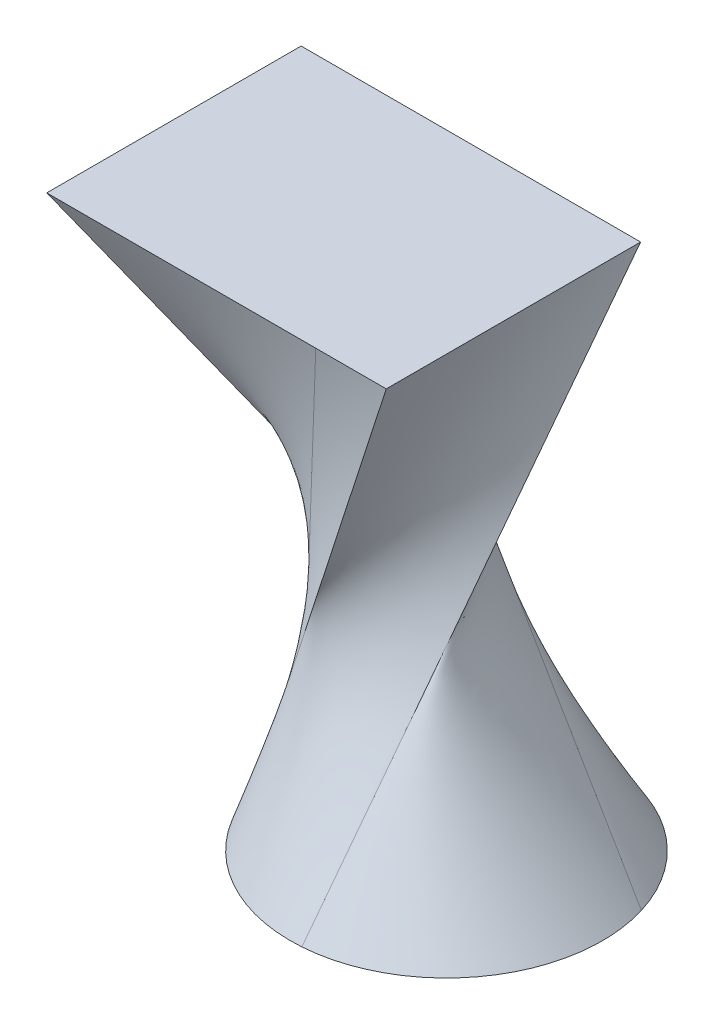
ISO-10303-21;
HEADER;
FILE_DESCRIPTION(('STEP AP214'),'2;1');
FILE_NAME('part.step','',(''),(''),'','','');
FILE_SCHEMA(('AUTOMOTIVE_DESIGN { 1 0 10303 214 1 1 1 1 }'));
ENDSEC;
DATA;
#1=APPLICATION_CONTEXT('core data for automotive mechanical design processes');
#2=APPLICATION_PROTOCOL_DEFINITION('international standard','automotive_design',2000,#1);
#3=PRODUCT_CONTEXT('',#1,'mechanical');
#4=PRODUCT('Part','Part','',(#3));
#5=PRODUCT_RELATED_PRODUCT_CATEGORY('part','',(#4));
#6=PRODUCT_DEFINITION_FORMATION('','',#4);
#7=PRODUCT_DEFINITION_CONTEXT('part definition',#1,'design');
#8=PRODUCT_DEFINITION('design','',#6,#7);
#9=PRODUCT_DEFINITION_SHAPE('','',#8);
#10=(LENGTH_UNIT() NAMED_UNIT(*) SI_UNIT(.MILLI.,.METRE.));
#11=(NAMED_UNIT(*) PLANE_ANGLE_UNIT() SI_UNIT($,.RADIAN.));
#12=(NAMED_UNIT(*) SI_UNIT($,.STERADIAN.) SOLID_ANGLE_UNIT());
#13=UNCERTAINTY_MEASURE_WITH_UNIT(LENGTH_MEASURE(1.E-05),#10,'distance_accuracy_value','');
#14=(GEOMETRIC_REPRESENTATION_CONTEXT(3) GLOBAL_UNCERTAINTY_ASSIGNED_CONTEXT((#13)) GLOBAL_UNIT_ASSIGNED_CONTEXT((#10,
#11,#12)) REPRESENTATION_CONTEXT('',''));
#15=CARTESIAN_POINT('',(0.,0.,0.));
#16=DIRECTION('',(0.,0.,1.));
#17=DIRECTION('',(1.,0.,0.));
#18=AXIS2_PLACEMENT_3D('',#15,#16,#17);
#19=CARTESIAN_POINT('',(-18.3758165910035,177.8,32.8585585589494));
#20=CARTESIAN_POINT('',(-61.0265949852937,0.,-4.67272512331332));
#21=CARTESIAN_POINT('',(-22.7694829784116,177.8,32.8585585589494));
#22=CARTESIAN_POINT('',(-60.7495294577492,0.,-8.29124863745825));
#23=CARTESIAN_POINT('',(-31.556815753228,177.8,32.8585585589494));
#24=CARTESIAN_POINT('',(-59.550185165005,0.,-15.4788341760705));
#25=CARTESIAN_POINT('',(-44.7378149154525,177.8,32.8585585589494));
#26=CARTESIAN_POINT('',(-55.8714944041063,0.,-25.7717478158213));
#27=CARTESIAN_POINT('',(-57.9188140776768,177.8,32.8585585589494));
#28=CARTESIAN_POINT('',(-50.4297180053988,0.,-35.2513310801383));
#29=CARTESIAN_POINT('',(-71.0998132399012,177.8,32.8585585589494));
#30=CARTESIAN_POINT('',(-43.3963563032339,0.,-43.6184071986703));
#31=CARTESIAN_POINT('',(-84.2808124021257,177.8,32.8585585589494));
#32=CARTESIAN_POINT('',(-34.993492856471,0.,-50.6089740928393));
#33=CARTESIAN_POINT('',(-97.4618115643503,177.8,32.8585585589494));
#34=CARTESIAN_POINT('',(-25.4862597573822,0.,-56.00229848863));
#35=CARTESIAN_POINT('',(-110.642810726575,177.8,32.8585585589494));
#36=CARTESIAN_POINT('',(-15.1747051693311,0.,-59.6284091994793));
#37=CARTESIAN_POINT('',(-119.430143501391,177.8,32.8585585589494));
#38=CARTESIAN_POINT('',(-7.98109212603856,0.,-60.791054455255));
#39=CARTESIAN_POINT('',(-123.823809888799,177.8,32.8585585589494));
#40=CARTESIAN_POINT('',(-4.36120167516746,0.,-61.0496484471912));
#41=B_SPLINE_SURFACE_WITH_KNOTS('',3,1,((#19,#20),(#21,#22),(#23,#24),(#25,#26),(#27,#28),(#29,
#30),(#31,#32),(#33,#34),(#35,#36),(#37,#38),(#39,#40)),.UNSPECIFIED.,.F.,.F.,.F.,(4,1,1,1,1,1,
1,1,4),(2,2),(0.,0.125,0.25,0.375,0.5,0.625,0.75,0.875,1.),(0.,1.),.UNSPECIFIED.);
#42=DIRECTION('',(-1.,0.,0.));
#43=VECTOR('',#42,1.);
#44=CARTESIAN_POINT('',(-71.0998132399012,177.8,32.8585585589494));
#45=LINE('',#44,#43);
#46=CARTESIAN_POINT('',(-18.3758165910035,177.8,32.8585585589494));
#47=VERTEX_POINT('',#46);
#48=CARTESIAN_POINT('',(-123.823809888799,177.8,32.8585585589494));
#49=VERTEX_POINT('',#48);
#50=EDGE_CURVE('E12',#47,#49,#45,.T.);
#51=DIRECTION('',(0.510771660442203,-0.760197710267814,-0.401511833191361));
#52=VECTOR('',#51,1.);
#53=CARTESIAN_POINT('',(-64.0925057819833,88.9,-14.0955449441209));
#54=LINE('',#53,#52);
#55=CARTESIAN_POINT('',(-4.36120167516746,0.,-61.0496484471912));
#56=VERTEX_POINT('',#55);
#57=EDGE_CURVE('E134',#49,#56,#54,.T.);
#58=CARTESIAN_POINT('',(0.,0.,0.));
#59=DIRECTION('',(0.,-1.,0.));
#60=DIRECTION('',(0.,0.,1.));
#61=AXIS2_PLACEMENT_3D('',#58,#59,#60);
#62=CIRCLE('',#61,61.2052257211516);
#63=CARTESIAN_POINT('',(-61.0265949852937,0.,-4.67272512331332));
#64=VERTEX_POINT('',#63);
#65=EDGE_CURVE('E385',#64,#56,#62,.T.);
#66=DIRECTION('',(-0.228499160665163,-0.952553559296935,-0.201071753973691));
#67=VECTOR('',#66,1.);
#68=CARTESIAN_POINT('',(-39.7012057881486,88.9,14.092916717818));
#69=LINE('',#68,#67);
#70=EDGE_CURVE('E306',#47,#64,#69,.T.);
#71=ORIENTED_EDGE('',*,*,#50,.T.);
#72=ORIENTED_EDGE('',*,*,#57,.T.);
#73=ORIENTED_EDGE('',*,*,#65,.F.);
#74=ORIENTED_EDGE('',*,*,#70,.F.);
#75=EDGE_LOOP('',(#71,#72,#73,#74));
#76=FACE_BOUND('',#75,.T.);
#77=ADVANCED_FACE('F129',(#76),#41,.T.);
#78=CARTESIAN_POINT('',(-123.823809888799,177.8,32.8585585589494));
#79=CARTESIAN_POINT('',(-4.36120167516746,0.,-61.0496484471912));
#80=CARTESIAN_POINT('',(-123.823809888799,177.8,28.7040554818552));
#81=CARTESIAN_POINT('',(-0.938355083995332,0.,-61.2941662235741));
#82=CARTESIAN_POINT('',(-123.823809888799,177.8,20.395049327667));
#83=CARTESIAN_POINT('',(5.94852363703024,0.,-61.2062388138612));
#84=CARTESIAN_POINT('',(-123.823809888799,177.8,7.93154009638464));
#85=CARTESIAN_POINT('',(16.110976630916,0.,-59.3465704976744));
#86=CARTESIAN_POINT('',(-123.823809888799,177.8,-4.53196913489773));
#87=CARTESIAN_POINT('',(25.8186993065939,0.,-55.8119942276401));
#88=CARTESIAN_POINT('',(-123.823809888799,177.8,-16.9954783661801));
#89=CARTESIAN_POINT('',(34.7976924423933,0.,-50.7020845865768));
#90=CARTESIAN_POINT('',(-123.823809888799,177.8,-29.4589875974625));
#91=CARTESIAN_POINT('',(42.7945646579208,0.,-44.1611726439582));
#92=CARTESIAN_POINT('',(-123.823809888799,177.8,-41.9224968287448));
#93=CARTESIAN_POINT('',(49.5835219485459,0.,-36.3738003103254));
#94=CARTESIAN_POINT('',(-123.823809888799,177.8,-54.3860060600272));
#95=CARTESIAN_POINT('',(54.9731226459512,0.,-27.5598329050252));
#96=CARTESIAN_POINT('',(-123.823809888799,177.8,-62.6950122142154));
#97=CARTESIAN_POINT('',(57.5316274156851,0.,-21.1652349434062));
#98=CARTESIAN_POINT('',(-123.823809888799,177.8,-66.8495152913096));
#99=CARTESIAN_POINT('',(58.5342898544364,0.,-17.8834159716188));
#100=B_SPLINE_SURFACE_WITH_KNOTS('',3,1,((#78,#79),(#80,#81),(#82,#83),(#84,#85),(#86,#87),(#88,
#89),(#90,#91),(#92,#93),(#94,#95),(#96,#97),(#98,#99)),.UNSPECIFIED.,.F.,.F.,.F.,(4,1,1,1,1,1,
1,1,4),(2,2),(0.,0.125,0.25,0.375,0.5,0.625,0.75,0.875,1.),(0.,1.),.UNSPECIFIED.);
#101=DIRECTION('',(0.,0.,-1.));
#102=VECTOR('',#101,1.);
#103=CARTESIAN_POINT('',(-123.823809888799,177.8,-16.9954783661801));
#104=LINE('',#103,#102);
#105=CARTESIAN_POINT('',(-123.823809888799,177.8,-66.8495152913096));
#106=VERTEX_POINT('',#105);
#107=EDGE_CURVE('E149',#49,#106,#104,.T.);
#108=DIRECTION('',(0.703121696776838,-0.685546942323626,0.188799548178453));
#109=VECTOR('',#108,1.);
#110=CARTESIAN_POINT('',(-32.6447600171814,88.9,-42.3664656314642));
#111=LINE('',#110,#109);
#112=CARTESIAN_POINT('',(58.5342898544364,0.,-17.8834159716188));
#113=VERTEX_POINT('',#112);
#114=EDGE_CURVE('E376',#106,#113,#111,.T.);
#115=CARTESIAN_POINT('',(0.,0.,0.));
#116=DIRECTION('',(0.,-1.,0.));
#117=DIRECTION('',(0.,0.,1.));
#118=AXIS2_PLACEMENT_3D('',#115,#116,#117);
#119=CIRCLE('',#118,61.2052257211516);
#120=EDGE_CURVE('E196',#56,#113,#119,.T.);
#121=ORIENTED_EDGE('',*,*,#107,.T.);
#122=ORIENTED_EDGE('',*,*,#114,.T.);
#123=ORIENTED_EDGE('',*,*,#120,.F.);
#124=ORIENTED_EDGE('',*,*,#57,.F.);
#125=EDGE_LOOP('',(#121,#122,#123,#124));
#126=FACE_BOUND('',#125,.T.);
#127=ADVANCED_FACE('F231',(#126),#100,.T.);
#128=CARTESIAN_POINT('',(-123.823809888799,177.8,-66.8495152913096));
#129=CARTESIAN_POINT('',(58.5342898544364,0.,-17.8834159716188));
#130=CARTESIAN_POINT('',(-118.278721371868,177.8,-66.8495152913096));
#131=CARTESIAN_POINT('',(59.8725610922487,0.,-13.5031143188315));
#132=CARTESIAN_POINT('',(-107.188544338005,177.8,-66.8495152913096));
#133=CARTESIAN_POINT('',(61.5619128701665,0.,-4.44110122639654));
#134=CARTESIAN_POINT('',(-90.5532787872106,177.8,-66.8495152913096));
#135=CARTESIAN_POINT('',(61.0054765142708,0.,9.37523626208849));
#136=CARTESIAN_POINT('',(-73.9180132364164,177.8,-66.8495152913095));
#137=CARTESIAN_POINT('',(57.3876152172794,0.,22.7208732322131));
#138=CARTESIAN_POINT('',(-57.2827476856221,177.8,-66.8495152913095));
#139=CARTESIAN_POINT('',(50.8893694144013,0.,34.9262291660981));
#140=CARTESIAN_POINT('',(-40.6474821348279,177.8,-66.8495152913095));
#141=CARTESIAN_POINT('',(41.8371388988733,0.,45.37874248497));
#142=CARTESIAN_POINT('',(-24.0122165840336,177.8,-66.8495152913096));
#143=CARTESIAN_POINT('',(30.6851406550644,0.,53.5535746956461));
#144=CARTESIAN_POINT('',(-7.37695103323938,177.8,-66.8495152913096));
#145=CARTESIAN_POINT('',(17.993066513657,0.,59.0410200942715));
#146=CARTESIAN_POINT('',(3.71322600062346,177.8,-66.8495152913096));
#147=CARTESIAN_POINT('',(8.92973537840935,0.,60.7232862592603));
#148=CARTESIAN_POINT('',(9.25831451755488,177.8,-66.8495152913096));
#149=CARTESIAN_POINT('',(4.3612016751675,0.,61.0496484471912));
#150=B_SPLINE_SURFACE_WITH_KNOTS('',3,1,((#128,#129),(#130,#131),(#132,#133),(#134,#135),(#136,
#137),(#138,#139),(#140,#141),(#142,#143),(#144,#145),(#146,#147),(#148,#149)),.UNSPECIFIED.,
.F.,.F.,.F.,(4,1,1,1,1,1,1,1,4),(2,2),(0.,0.125,0.25,0.375,0.5,0.625,0.75,0.875,1.),(0.,1.),.UNSPECIFIED.);
#151=DIRECTION('',(1.,0.,0.));
#152=VECTOR('',#151,1.);
#153=CARTESIAN_POINT('',(-57.2827476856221,177.8,-66.8495152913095));
#154=LINE('',#153,#152);
#155=CARTESIAN_POINT('',(9.25831451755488,177.8,-66.8495152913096));
#156=VERTEX_POINT('',#155);
#157=EDGE_CURVE('E208',#106,#156,#154,.T.);
#158=DIRECTION('',(-0.0223533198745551,-0.811584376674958,0.583807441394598));
#159=VECTOR('',#158,1.);
#160=CARTESIAN_POINT('',(6.80975809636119,88.9,-2.89993342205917));
#161=LINE('',#160,#159);
#162=CARTESIAN_POINT('',(4.3612016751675,0.,61.0496484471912));
#163=VERTEX_POINT('',#162);
#164=EDGE_CURVE('E181',#156,#163,#161,.T.);
#165=CARTESIAN_POINT('',(0.,0.,0.));
#166=DIRECTION('',(0.,-1.,0.));
#167=DIRECTION('',(0.,0.,1.));
#168=AXIS2_PLACEMENT_3D('',#165,#166,#167);
#169=CIRCLE('',#168,61.2052257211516);
#170=EDGE_CURVE('E188',#113,#163,#169,.T.);
#171=ORIENTED_EDGE('',*,*,#157,.T.);
#172=ORIENTED_EDGE('',*,*,#164,.T.);
#173=ORIENTED_EDGE('',*,*,#170,.F.);
#174=ORIENTED_EDGE('',*,*,#114,.F.);
#175=EDGE_LOOP('',(#171,#172,#173,#174));
#176=FACE_BOUND('',#175,.T.);
#177=ADVANCED_FACE('F207',(#176),#150,.T.);
#178=CARTESIAN_POINT('',(9.25831451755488,177.8,-66.8495152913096));
#179=CARTESIAN_POINT('',(4.3612016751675,0.,61.0496484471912));
#180=CARTESIAN_POINT('',(9.25831451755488,177.8,-62.6950122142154));
#181=CARTESIAN_POINT('',(0.938355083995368,0.,61.2941662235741));
#182=CARTESIAN_POINT('',(9.25831451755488,177.8,-54.3860060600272));
#183=CARTESIAN_POINT('',(-5.94852363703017,0.,61.2062388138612));
#184=CARTESIAN_POINT('',(9.25831451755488,177.8,-41.9224968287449));
#185=CARTESIAN_POINT('',(-16.1109766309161,0.,59.3465704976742));
#186=CARTESIAN_POINT('',(9.25831451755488,177.8,-29.4589875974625));
#187=CARTESIAN_POINT('',(-25.8186993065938,0.,55.8119942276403));
#188=CARTESIAN_POINT('',(9.25831451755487,177.8,-16.9954783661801));
#189=CARTESIAN_POINT('',(-34.7976924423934,0.,50.7020845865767));
#190=CARTESIAN_POINT('',(9.25831451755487,177.8,-4.53196913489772));
#191=CARTESIAN_POINT('',(-42.7945646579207,0.,44.1611726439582));
#192=CARTESIAN_POINT('',(9.25831451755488,177.8,7.93154009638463));
#193=CARTESIAN_POINT('',(-49.5835219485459,0.,36.3738003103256));
#194=CARTESIAN_POINT('',(9.25831451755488,177.8,20.395049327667));
#195=CARTESIAN_POINT('',(-54.9731226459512,0.,27.5598329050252));
#196=CARTESIAN_POINT('',(9.25831451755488,177.8,28.7040554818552));
#197=CARTESIAN_POINT('',(-57.5316274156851,0.,21.1652349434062));
#198=CARTESIAN_POINT('',(9.25831451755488,177.8,32.8585585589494));
#199=CARTESIAN_POINT('',(-58.5342898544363,0.,17.8834159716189));
#200=B_SPLINE_SURFACE_WITH_KNOTS('',3,1,((#178,#179),(#180,#181),(#182,#183),(#184,#185),(#186,
#187),(#188,#189),(#190,#191),(#192,#193),(#194,#195),(#196,#197),(#198,#199)),.UNSPECIFIED.,
.F.,.F.,.F.,(4,1,1,1,1,1,1,1,4),(2,2),(0.,0.125,0.25,0.375,0.5,0.625,0.75,0.875,1.),(0.,1.),.UNSPECIFIED.);
#201=DIRECTION('',(0.,0.,1.));
#202=VECTOR('',#201,1.);
#203=CARTESIAN_POINT('',(9.25831451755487,177.8,-16.9954783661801));
#204=LINE('',#203,#202);
#205=CARTESIAN_POINT('',(9.25831451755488,177.8,32.8585585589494));
#206=VERTEX_POINT('',#205);
#207=EDGE_CURVE('E210',#156,#206,#204,.T.);
#208=DIRECTION('',(-0.355169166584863,-0.931503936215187,-0.0784555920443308));
#209=VECTOR('',#208,1.);
#210=CARTESIAN_POINT('',(-24.6379876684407,88.9,25.3709872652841));
#211=LINE('',#210,#209);
#212=CARTESIAN_POINT('',(-58.5342898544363,0.,17.8834159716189));
#213=VERTEX_POINT('',#212);
#214=EDGE_CURVE('E184',#206,#213,#211,.T.);
#215=CARTESIAN_POINT('',(0.,0.,0.));
#216=DIRECTION('',(0.,1.,0.));
#217=DIRECTION('',(0.,0.,1.));
#218=AXIS2_PLACEMENT_3D('',#215,#216,#217);
#219=CIRCLE('',#218,61.2052257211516);
#220=EDGE_CURVE('E175',#163,#213,#219,.F.);
#221=ORIENTED_EDGE('',*,*,#207,.T.);
#222=ORIENTED_EDGE('',*,*,#214,.T.);
#223=ORIENTED_EDGE('',*,*,#220,.F.);
#224=ORIENTED_EDGE('',*,*,#164,.F.);
#225=EDGE_LOOP('',(#221,#222,#223,#224));
#226=FACE_BOUND('',#225,.T.);
#227=ADVANCED_FACE('F179',(#226),#200,.T.);
#228=CARTESIAN_POINT('',(9.25831451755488,177.8,32.8585585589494));
#229=CARTESIAN_POINT('',(-58.5342898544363,0.,17.8834159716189));
#230=CARTESIAN_POINT('',(6.95547025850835,177.8,32.8585585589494));
#231=CARTESIAN_POINT('',(-59.0900664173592,0.,16.0643011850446));
#232=CARTESIAN_POINT('',(2.34978174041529,177.8,32.8585585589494));
#233=CARTESIAN_POINT('',(-60.0319063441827,0.,12.3742225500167));
#234=CARTESIAN_POINT('',(-4.5587510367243,177.8,32.8585585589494));
#235=CARTESIAN_POINT('',(-60.9231908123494,0.,6.73161160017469));
#236=CARTESIAN_POINT('',(-11.4672838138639,177.8,32.8585585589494));
#237=CARTESIAN_POINT('',(-61.2853095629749,0.,1.03053132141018));
#238=CARTESIAN_POINT('',(-16.072972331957,177.8,32.8585585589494));
#239=CARTESIAN_POINT('',(-61.1718128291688,0.,-2.77615506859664));
#240=CARTESIAN_POINT('',(-18.3758165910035,177.8,32.8585585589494));
#241=CARTESIAN_POINT('',(-61.0265949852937,0.,-4.67272512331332));
#242=B_SPLINE_SURFACE_WITH_KNOTS('',3,1,((#228,#229),(#230,#231),(#232,#233),(#234,#235),(#236,
#237),(#238,#239),(#240,#241)),.UNSPECIFIED.,.F.,.F.,.F.,(4,1,1,1,4),(2,2),(0.,0.25,0.5,0.75,
1.),(0.,1.),.UNSPECIFIED.);
#243=DIRECTION('',(-1.,0.,0.));
#244=VECTOR('',#243,1.);
#245=CARTESIAN_POINT('',(-4.5587510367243,177.8,32.8585585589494));
#246=LINE('',#245,#244);
#247=EDGE_CURVE('E303',#206,#47,#246,.T.);
#248=CARTESIAN_POINT('',(0.,0.,0.));
#249=DIRECTION('',(0.,-1.,0.));
#250=DIRECTION('',(0.,0.,1.));
#251=AXIS2_PLACEMENT_3D('',#248,#249,#250);
#252=CIRCLE('',#251,61.2052257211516);
#253=EDGE_CURVE('E189',#213,#64,#252,.T.);
#254=ORIENTED_EDGE('',*,*,#247,.T.);
#255=ORIENTED_EDGE('',*,*,#70,.T.);
#256=ORIENTED_EDGE('',*,*,#253,.F.);
#257=ORIENTED_EDGE('',*,*,#214,.F.);
#258=EDGE_LOOP('',(#254,#255,#256,#257));
#259=FACE_BOUND('',#258,.T.);
#260=ADVANCED_FACE('F278',(#259),#242,.T.);
#261=CARTESIAN_POINT('',(0.,177.8,0.));
#262=DIRECTION('',(0.,-1.,0.));
#263=DIRECTION('',(0.,0.,-1.));
#264=AXIS2_PLACEMENT_3D('',#261,#262,#263);
#265=PLANE('',#264);
#266=ORIENTED_EDGE('',*,*,#247,.F.);
#267=ORIENTED_EDGE('',*,*,#207,.F.);
#268=ORIENTED_EDGE('',*,*,#157,.F.);
#269=ORIENTED_EDGE('',*,*,#107,.F.);
#270=ORIENTED_EDGE('',*,*,#50,.F.);
#271=EDGE_LOOP('',(#266,#267,#268,#269,#270));
#272=FACE_BOUND('',#271,.T.);
#273=ADVANCED_FACE('F270',(#272),#265,.F.);
#274=CARTESIAN_POINT('',(0.,0.,0.));
#275=DIRECTION('',(0.,-1.,0.));
#276=DIRECTION('',(0.,0.,-1.));
#277=AXIS2_PLACEMENT_3D('',#274,#275,#276);
#278=PLANE('',#277);
#279=ORIENTED_EDGE('',*,*,#65,.T.);
#280=ORIENTED_EDGE('',*,*,#120,.T.);
#281=ORIENTED_EDGE('',*,*,#170,.T.);
#282=ORIENTED_EDGE('',*,*,#220,.T.);
#283=ORIENTED_EDGE('',*,*,#253,.T.);
#284=EDGE_LOOP('',(#279,#280,#281,#282,#283));
#285=FACE_BOUND('',#284,.T.);
#286=ADVANCED_FACE('F131',(#285),#278,.T.);
#287=CLOSED_SHELL('',(#77,#127,#177,#227,#260,#273,#286));
#288=MANIFOLD_SOLID_BREP('B2',#287);
#289=ADVANCED_BREP_SHAPE_REPRESENTATION('',(#18,#288),#14);
#290=SHAPE_DEFINITION_REPRESENTATION(#9,#289);
ENDSEC;
END-ISO-10303-21;
